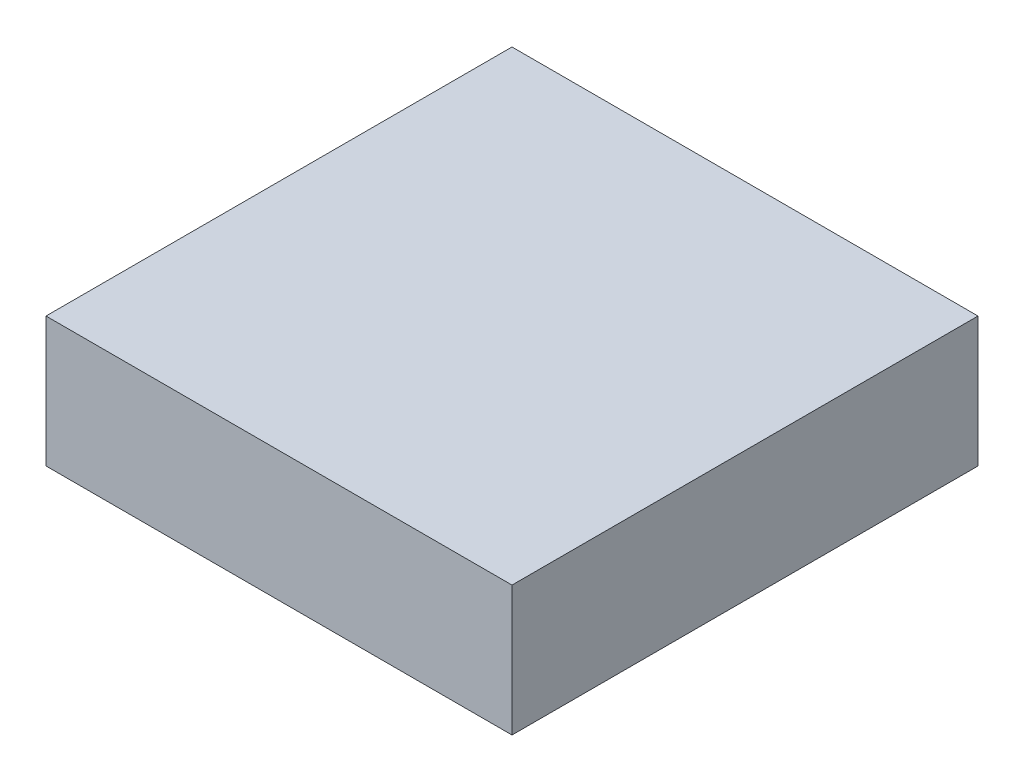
ISO-10303-21;
HEADER;
FILE_DESCRIPTION(('STEP AP214'),'2;1');
FILE_NAME('part.step','',(''),(''),'','','');
FILE_SCHEMA(('AUTOMOTIVE_DESIGN { 1 0 10303 214 1 1 1 1 }'));
ENDSEC;
DATA;
#1=APPLICATION_CONTEXT('core data for automotive mechanical design processes');
#2=APPLICATION_PROTOCOL_DEFINITION('international standard','automotive_design',2000,#1);
#3=PRODUCT_CONTEXT('',#1,'mechanical');
#4=PRODUCT('Part','Part','',(#3));
#5=PRODUCT_RELATED_PRODUCT_CATEGORY('part','',(#4));
#6=PRODUCT_DEFINITION_FORMATION('','',#4);
#7=PRODUCT_DEFINITION_CONTEXT('part definition',#1,'design');
#8=PRODUCT_DEFINITION('design','',#6,#7);
#9=PRODUCT_DEFINITION_SHAPE('','',#8);
#10=(LENGTH_UNIT() NAMED_UNIT(*) SI_UNIT(.MILLI.,.METRE.));
#11=(NAMED_UNIT(*) PLANE_ANGLE_UNIT() SI_UNIT($,.RADIAN.));
#12=(NAMED_UNIT(*) SI_UNIT($,.STERADIAN.) SOLID_ANGLE_UNIT());
#13=UNCERTAINTY_MEASURE_WITH_UNIT(LENGTH_MEASURE(1.E-05),#10,'distance_accuracy_value','');
#14=(GEOMETRIC_REPRESENTATION_CONTEXT(3) GLOBAL_UNCERTAINTY_ASSIGNED_CONTEXT((#13)) GLOBAL_UNIT_ASSIGNED_CONTEXT((#10,
#11,#12)) REPRESENTATION_CONTEXT('',''));
#15=CARTESIAN_POINT('',(0.,0.,0.));
#16=DIRECTION('',(0.,0.,1.));
#17=DIRECTION('',(1.,0.,0.));
#18=AXIS2_PLACEMENT_3D('',#15,#16,#17);
#19=CARTESIAN_POINT('',(0.,0.,0.4499991));
#20=DIRECTION('',(0.,0.,1.));
#21=DIRECTION('',(1.,0.,0.));
#22=AXIS2_PLACEMENT_3D('',#19,#20,#21);
#23=PLANE('',#22);
#24=DIRECTION('',(0.,-1.,0.));
#25=VECTOR('',#24,1.);
#26=CARTESIAN_POINT('',(-0.22500336,0.06271259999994,0.4499991));
#27=LINE('',#26,#25);
#28=CARTESIAN_POINT('',(-0.22500336,0.06271259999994,0.4499991));
#29=VERTEX_POINT('',#28);
#30=CARTESIAN_POINT('',(-0.22500336,-0.06271260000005,0.4499991));
#31=VERTEX_POINT('',#30);
#32=EDGE_CURVE('E82',#29,#31,#27,.T.);
#33=ORIENTED_EDGE('',*,*,#32,.T.);
#34=DIRECTION('',(1.,0.,0.));
#35=VECTOR('',#34,1.);
#36=CARTESIAN_POINT('',(-0.22500336,-0.06271260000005,0.4499991));
#37=LINE('',#36,#35);
#38=CARTESIAN_POINT('',(0.22500336,-0.06271260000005,0.4499991));
#39=VERTEX_POINT('',#38);
#40=EDGE_CURVE('E102',#31,#39,#37,.T.);
#41=ORIENTED_EDGE('',*,*,#40,.T.);
#42=DIRECTION('',(0.,1.,0.));
#43=VECTOR('',#42,1.);
#44=CARTESIAN_POINT('',(0.22500336,-0.06271260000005,0.4499991));
#45=LINE('',#44,#43);
#46=CARTESIAN_POINT('',(0.22500336,0.06271259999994,0.4499991));
#47=VERTEX_POINT('',#46);
#48=EDGE_CURVE('E75',#39,#47,#45,.T.);
#49=ORIENTED_EDGE('',*,*,#48,.T.);
#50=DIRECTION('',(-1.,0.,0.));
#51=VECTOR('',#50,1.);
#52=CARTESIAN_POINT('',(0.22500336,0.06271259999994,0.4499991));
#53=LINE('',#52,#51);
#54=EDGE_CURVE('E11',#47,#29,#53,.T.);
#55=ORIENTED_EDGE('',*,*,#54,.T.);
#56=EDGE_LOOP('',(#33,#41,#49,#55));
#57=FACE_BOUND('',#56,.T.);
#58=ADVANCED_FACE('F17',(#57),#23,.T.);
#59=CARTESIAN_POINT('',(0.,0.,0.));
#60=DIRECTION('',(0.,0.,1.));
#61=DIRECTION('',(1.,0.,0.));
#62=AXIS2_PLACEMENT_3D('',#59,#60,#61);
#63=PLANE('',#62);
#64=DIRECTION('',(-1.,0.,0.));
#65=VECTOR('',#64,1.);
#66=CARTESIAN_POINT('',(0.22500336,0.06271259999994,0.));
#67=LINE('',#66,#65);
#68=CARTESIAN_POINT('',(0.22500336,0.06271259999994,0.));
#69=VERTEX_POINT('',#68);
#70=CARTESIAN_POINT('',(-0.22500336,0.06271259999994,0.));
#71=VERTEX_POINT('',#70);
#72=EDGE_CURVE('E20',#69,#71,#67,.T.);
#73=ORIENTED_EDGE('',*,*,#72,.F.);
#74=DIRECTION('',(0.,1.,0.));
#75=VECTOR('',#74,1.);
#76=CARTESIAN_POINT('',(0.22500336,-0.06271260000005,0.));
#77=LINE('',#76,#75);
#78=CARTESIAN_POINT('',(0.22500336,-0.06271260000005,0.));
#79=VERTEX_POINT('',#78);
#80=EDGE_CURVE('E106',#79,#69,#77,.T.);
#81=ORIENTED_EDGE('',*,*,#80,.F.);
#82=DIRECTION('',(1.,0.,0.));
#83=VECTOR('',#82,1.);
#84=CARTESIAN_POINT('',(-0.22500336,-0.06271260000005,0.));
#85=LINE('',#84,#83);
#86=CARTESIAN_POINT('',(-0.22500336,-0.06271260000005,0.));
#87=VERTEX_POINT('',#86);
#88=EDGE_CURVE('E84',#87,#79,#85,.T.);
#89=ORIENTED_EDGE('',*,*,#88,.F.);
#90=DIRECTION('',(0.,-1.,0.));
#91=VECTOR('',#90,1.);
#92=CARTESIAN_POINT('',(-0.22500336,0.06271259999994,0.));
#93=LINE('',#92,#91);
#94=EDGE_CURVE('E80',#71,#87,#93,.T.);
#95=ORIENTED_EDGE('',*,*,#94,.F.);
#96=EDGE_LOOP('',(#73,#81,#89,#95));
#97=FACE_BOUND('',#96,.T.);
#98=ADVANCED_FACE('F86',(#97),#63,.F.);
#99=CARTESIAN_POINT('',(0.22500336,0.06271259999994,0.));
#100=DIRECTION('',(0.,-1.,0.));
#101=DIRECTION('',(0.,0.,-1.));
#102=AXIS2_PLACEMENT_3D('',#99,#100,#101);
#103=PLANE('',#102);
#104=ORIENTED_EDGE('',*,*,#72,.T.);
#105=DIRECTION('',(0.,0.,1.));
#106=VECTOR('',#105,1.);
#107=CARTESIAN_POINT('',(-0.22500336,0.06271259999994,0.));
#108=LINE('',#107,#106);
#109=EDGE_CURVE('E69',#71,#29,#108,.T.);
#110=ORIENTED_EDGE('',*,*,#109,.T.);
#111=ORIENTED_EDGE('',*,*,#54,.F.);
#112=DIRECTION('',(0.,0.,1.));
#113=VECTOR('',#112,1.);
#114=CARTESIAN_POINT('',(0.22500336,0.06271259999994,0.));
#115=LINE('',#114,#113);
#116=EDGE_CURVE('E72',#69,#47,#115,.T.);
#117=ORIENTED_EDGE('',*,*,#116,.F.);
#118=EDGE_LOOP('',(#104,#110,#111,#117));
#119=FACE_BOUND('',#118,.T.);
#120=ADVANCED_FACE('F68',(#119),#103,.F.);
#121=CARTESIAN_POINT('',(0.22500336,-0.06271260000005,0.));
#122=DIRECTION('',(-1.,0.,0.));
#123=DIRECTION('',(0.,0.,1.));
#124=AXIS2_PLACEMENT_3D('',#121,#122,#123);
#125=PLANE('',#124);
#126=ORIENTED_EDGE('',*,*,#80,.T.);
#127=ORIENTED_EDGE('',*,*,#116,.T.);
#128=ORIENTED_EDGE('',*,*,#48,.F.);
#129=DIRECTION('',(0.,0.,1.));
#130=VECTOR('',#129,1.);
#131=CARTESIAN_POINT('',(0.22500336,-0.06271260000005,0.));
#132=LINE('',#131,#130);
#133=EDGE_CURVE('E99',#79,#39,#132,.T.);
#134=ORIENTED_EDGE('',*,*,#133,.F.);
#135=EDGE_LOOP('',(#126,#127,#128,#134));
#136=FACE_BOUND('',#135,.T.);
#137=ADVANCED_FACE('F116',(#136),#125,.F.);
#138=CARTESIAN_POINT('',(-0.22500336,-0.06271260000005,0.));
#139=DIRECTION('',(0.,1.,0.));
#140=DIRECTION('',(1.,0.,0.));
#141=AXIS2_PLACEMENT_3D('',#138,#139,#140);
#142=PLANE('',#141);
#143=ORIENTED_EDGE('',*,*,#88,.T.);
#144=ORIENTED_EDGE('',*,*,#133,.T.);
#145=ORIENTED_EDGE('',*,*,#40,.F.);
#146=DIRECTION('',(0.,0.,1.));
#147=VECTOR('',#146,1.);
#148=CARTESIAN_POINT('',(-0.22500336,-0.06271260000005,0.));
#149=LINE('',#148,#147);
#150=EDGE_CURVE('E90',#87,#31,#149,.T.);
#151=ORIENTED_EDGE('',*,*,#150,.F.);
#152=EDGE_LOOP('',(#143,#144,#145,#151));
#153=FACE_BOUND('',#152,.T.);
#154=ADVANCED_FACE('F121',(#153),#142,.F.);
#155=CARTESIAN_POINT('',(-0.22500336,0.06271259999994,0.));
#156=DIRECTION('',(1.,0.,0.));
#157=DIRECTION('',(0.,1.,0.));
#158=AXIS2_PLACEMENT_3D('',#155,#156,#157);
#159=PLANE('',#158);
#160=ORIENTED_EDGE('',*,*,#94,.T.);
#161=ORIENTED_EDGE('',*,*,#150,.T.);
#162=ORIENTED_EDGE('',*,*,#32,.F.);
#163=ORIENTED_EDGE('',*,*,#109,.F.);
#164=EDGE_LOOP('',(#160,#161,#162,#163));
#165=FACE_BOUND('',#164,.T.);
#166=ADVANCED_FACE('F78',(#165),#159,.F.);
#167=CLOSED_SHELL('',(#58,#98,#120,#137,#154,#166));
#168=MANIFOLD_SOLID_BREP('B1',#167);
#169=ADVANCED_BREP_SHAPE_REPRESENTATION('',(#18,#168),#14);
#170=SHAPE_DEFINITION_REPRESENTATION(#9,#169);
ENDSEC;
END-ISO-10303-21;
